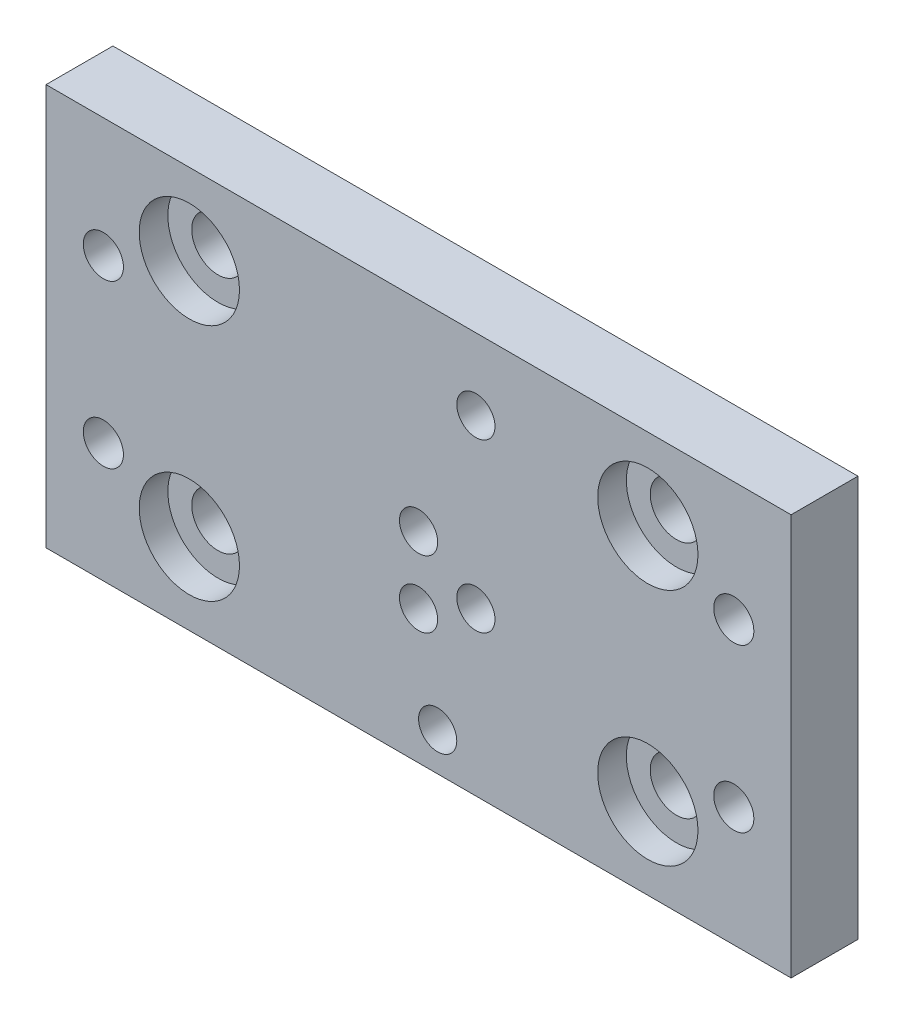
from build123d import *

# Parameters (mm, degrees)
ESQUISSE1_W                                     = 78
ESQUISSE1_H                                     = 42
EXTRUSION1_DEPTH                                = 7
TROU_TARAUD_M5X0_81_D                           = 4.2
CHAMBRAGE_POUR_VIS_T_TE_CYLINDRIQUE_D           = 5.5
CHAMBRAGE_POUR_VIS_T_TE_CYLINDRIQUE_DEPTH       = 9
CHAMBRAGE_POUR_VIS_T_TE_CYLINDRIQUE_CBORE_D     = 10.5
CHAMBRAGE_POUR_VIS_T_TE_CYLINDRIQUE_CBORE_DEPTH = 3
CHAMBRAGE_POUR_VIS_T_TE_CYLINDRIQUE_TIP         = 1.652366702
ESQUISSE6_R                                     = 1.1
ENL_V_MAT_EXTRU_1_DEPTH                         = 45.84417465
ESQUISSE7_R                                     = 2
ENL_V_MAT_EXTRU_2_DEPTH                         = 3


with BuildPart() as part:
    # Esquisse1 → Extrusion1 (new body)
    with BuildSketch(Plane.XY):
        Rectangle(ESQUISSE1_W, ESQUISSE1_H)
    extrude(amount=EXTRUSION1_DEPTH)

    # Trou taraud_ M5x0.81 (through all)
    with Locations(Plane.XY.offset(7)):
        with Locations((33, -8.5), (-33, -8.5), (-33, 8.5), (33, 8.5)):
            Hole(TROU_TARAUD_M5X0_81_D / 2)

    # Chambrage pour vis _ t_te cylindrique
    with Locations(Plane.XY.offset(7)):
        with Locations((-24, 12.5), (24, 12.5), (24, -12.5), (-24, -12.5)):
            CounterBoreHole(CHAMBRAGE_POUR_VIS_T_TE_CYLINDRIQUE_D / 2, CHAMBRAGE_POUR_VIS_T_TE_CYLINDRIQUE_CBORE_D / 2, CHAMBRAGE_POUR_VIS_T_TE_CYLINDRIQUE_CBORE_DEPTH, depth=CHAMBRAGE_POUR_VIS_T_TE_CYLINDRIQUE_DEPTH)
            with Locations((0, 0, -(CHAMBRAGE_POUR_VIS_T_TE_CYLINDRIQUE_DEPTH + CHAMBRAGE_POUR_VIS_T_TE_CYLINDRIQUE_TIP / 2))):  # 118° drill point
                Cone(0, CHAMBRAGE_POUR_VIS_T_TE_CYLINDRIQUE_D / 2, CHAMBRAGE_POUR_VIS_T_TE_CYLINDRIQUE_TIP, mode=Mode.SUBTRACT)

    # Esquisse6 → Enl_v. mat.-Extru.1 (cut, through all)
    with BuildSketch(Plane.XY.offset(7)):
        Circle(ESQUISSE6_R)
        with Locations((6, 13.5)):
            Circle(ESQUISSE6_R)
        with Locations((0, -7)):
            Circle(ESQUISSE6_R)
        with Locations((6, -4)):
            Circle(ESQUISSE6_R)
        with Locations((2, -17)):
            Circle(ESQUISSE6_R)
    extrude(amount=-ENL_V_MAT_EXTRU_1_DEPTH, mode=Mode.SUBTRACT)

    # Esquisse7 → Enl_v. mat.-Extru.2 (cut)
    with BuildSketch(Plane.XY.offset(7)):
        with Locations((6, 13.5)):
            Circle(ESQUISSE7_R)
        Circle(ESQUISSE7_R)
        with Locations((6, -4)):
            Circle(ESQUISSE7_R)
        with Locations((0, -7)):
            Circle(ESQUISSE7_R)
        with Locations((2, -17)):
            Circle(ESQUISSE7_R)
    extrude(amount=-ENL_V_MAT_EXTRU_2_DEPTH, mode=Mode.SUBTRACT)


solid = part.part
